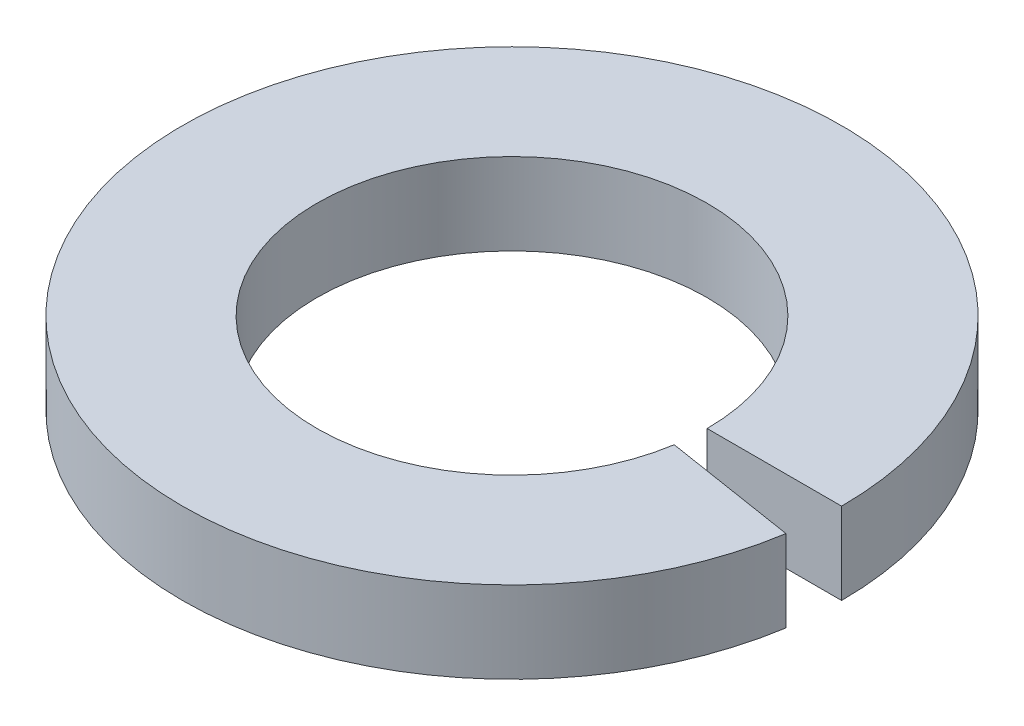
from build123d import *

# Parameters (mm, degrees)
SKETCH1_W          = 1.2954
SKETCH1_H          = 0.7874
BASE_REVOLVE_ANGLE = 351


with BuildPart() as part:
    # Sketch1 → Base-Revolve (revolve)
    with BuildSketch(Plane.XY):
        with Locations((2.5273, 0.3937)):
            Rectangle(SKETCH1_W, SKETCH1_H)
    revolve(axis=Axis((0, -39.37, 0), (0, 1, 0)), revolution_arc=BASE_REVOLVE_ANGLE)


solid = part.part
